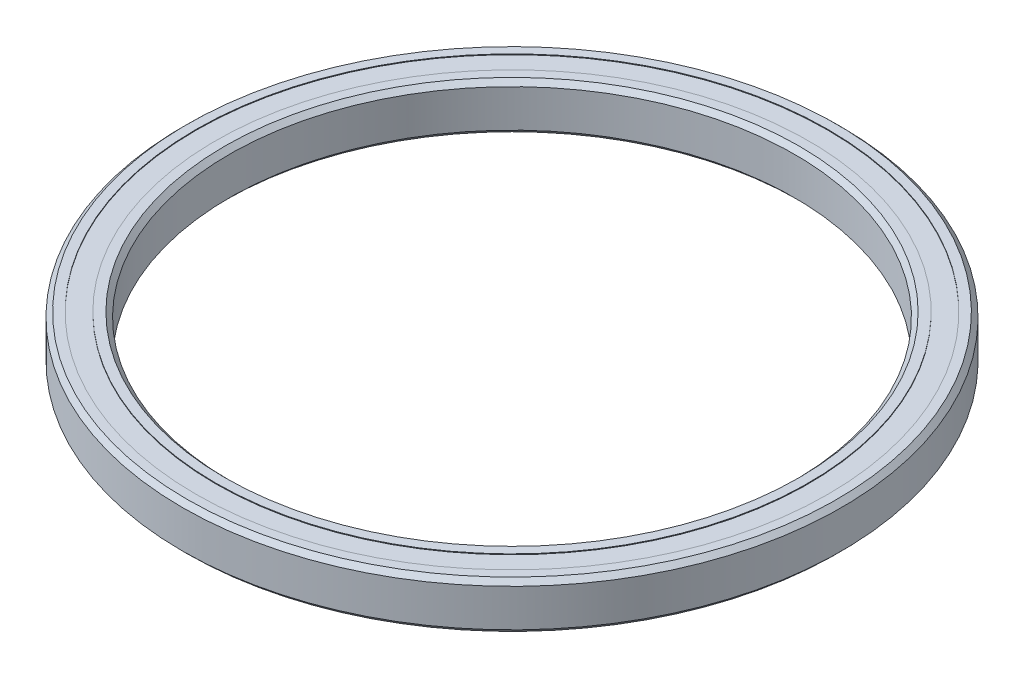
from build123d import *

# Parameters (mm, degrees)
SKETCH1_R          = 44.45
SKETCH1_R_2        = 38.1
EXTRUDE1_DEPTH     = 3.175
SKETCH2_R          = 42.6212
SKETCH2_R_2        = 39.9796
CUT_EXTRUDE1_DEPTH = 0.1
CHAMFER1_SIZE      = 0.635


with BuildPart() as part:
    # Sketch1 → Extrude1 (new, symmetric)
    with BuildSketch(Plane(origin=(0, 0, 0), x_dir=(1, 0, 0), z_dir=(0, 1, 0))):
        with Locations(Location((0, 0, 0), (0, 0, 270))):
            Circle(SKETCH1_R)
        with Locations(Location((0, 0, 0), (0, 0, 270))):
            Circle(SKETCH1_R_2, mode=Mode.SUBTRACT)
    extrude(amount=EXTRUDE1_DEPTH, both=True)

    # Sketch2 → Cut-Extrude1 (cut)
    with BuildSketch(Plane(origin=(0, 3.175, 0), x_dir=(-1, 0, 0), z_dir=(0, 1, 0))):
        with Locations(Location((0, 0, 0), (0, 0, 90))):
            Circle(SKETCH2_R)
        with Locations(Location((0, 0, 0), (0, 0, 90))):
            Circle(SKETCH2_R_2, mode=Mode.SUBTRACT)
    cut_extrude1 = extrude(amount=-CUT_EXTRUDE1_DEPTH, mode=Mode.SUBTRACT)

    # Mirror1: Cut-Extrude1 across plane
    add(cut_extrude1.mirror(Plane.ZX), mode=Mode.SUBTRACT)

    # Chamfer1
    chamfer1_edges = [part.edges().sort_by_distance(p)[0] for p in [
        (0, -3.175, -44.45),
        (0, 3.175, -44.45),
        (0, -3.175, -38.1),
        (0, 3.175, -38.1),
    ]]
    chamfer(chamfer1_edges, length=CHAMFER1_SIZE)


solid = part.part
